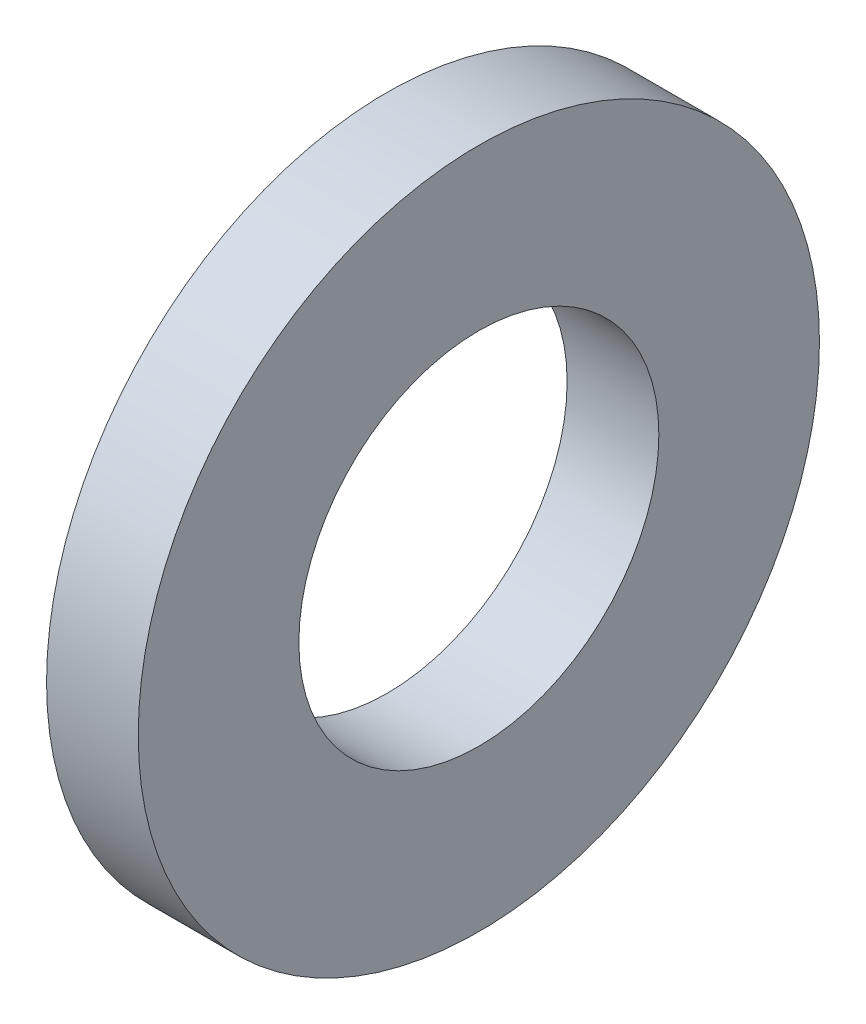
ISO-10303-21;
HEADER;
FILE_DESCRIPTION(('STEP AP214'),'2;1');
FILE_NAME('part.step','',(''),(''),'','','');
FILE_SCHEMA(('AUTOMOTIVE_DESIGN { 1 0 10303 214 1 1 1 1 }'));
ENDSEC;
DATA;
#1=APPLICATION_CONTEXT('core data for automotive mechanical design processes');
#2=APPLICATION_PROTOCOL_DEFINITION('international standard','automotive_design',2000,#1);
#3=PRODUCT_CONTEXT('',#1,'mechanical');
#4=PRODUCT('Part','Part','',(#3));
#5=PRODUCT_RELATED_PRODUCT_CATEGORY('part','',(#4));
#6=PRODUCT_DEFINITION_FORMATION('','',#4);
#7=PRODUCT_DEFINITION_CONTEXT('part definition',#1,'design');
#8=PRODUCT_DEFINITION('design','',#6,#7);
#9=PRODUCT_DEFINITION_SHAPE('','',#8);
#10=(LENGTH_UNIT() NAMED_UNIT(*) SI_UNIT(.MILLI.,.METRE.));
#11=(NAMED_UNIT(*) PLANE_ANGLE_UNIT() SI_UNIT($,.RADIAN.));
#12=(NAMED_UNIT(*) SI_UNIT($,.STERADIAN.) SOLID_ANGLE_UNIT());
#13=UNCERTAINTY_MEASURE_WITH_UNIT(LENGTH_MEASURE(1.E-05),#10,'distance_accuracy_value','');
#14=(GEOMETRIC_REPRESENTATION_CONTEXT(3) GLOBAL_UNCERTAINTY_ASSIGNED_CONTEXT((#13)) GLOBAL_UNIT_ASSIGNED_CONTEXT((#10,
#11,#12)) REPRESENTATION_CONTEXT('',''));
#15=CARTESIAN_POINT('',(0.,0.,0.));
#16=DIRECTION('',(0.,0.,1.));
#17=DIRECTION('',(1.,0.,0.));
#18=AXIS2_PLACEMENT_3D('',#15,#16,#17);
#19=CARTESIAN_POINT('',(-1.75,6.5,0.));
#20=DIRECTION('',(1.,0.,0.));
#21=DIRECTION('',(0.,0.,-1.));
#22=AXIS2_PLACEMENT_3D('',#19,#20,#21);
#23=PLANE('',#22);
#24=CARTESIAN_POINT('',(-1.74999999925,0.,0.));
#25=DIRECTION('',(-1.,0.,0.));
#26=DIRECTION('',(0.,0.,1.));
#27=AXIS2_PLACEMENT_3D('',#24,#25,#26);
#28=CIRCLE('',#27,3.435);
#29=CARTESIAN_POINT('',(-1.74999999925,0.,3.435));
#30=VERTEX_POINT('',#29);
#31=EDGE_CURVE('E27',#30,#30,#28,.F.);
#32=ORIENTED_EDGE('',*,*,#31,.T.);
#33=EDGE_LOOP('',(#32));
#34=FACE_BOUND('',#33,.T.);
#35=CARTESIAN_POINT('',(-1.75,0.,0.));
#36=DIRECTION('',(-1.,0.,0.));
#37=DIRECTION('',(0.,0.,1.));
#38=AXIS2_PLACEMENT_3D('',#35,#36,#37);
#39=CIRCLE('',#38,6.5);
#40=CARTESIAN_POINT('',(-1.75,0.,6.5));
#41=VERTEX_POINT('',#40);
#42=EDGE_CURVE('E18',#41,#41,#39,.F.);
#43=ORIENTED_EDGE('',*,*,#42,.F.);
#44=EDGE_LOOP('',(#43));
#45=FACE_BOUND('',#44,.T.);
#46=ADVANCED_FACE('F15',(#34,#45),#23,.F.);
#47=CARTESIAN_POINT('',(-34.925,0.,0.));
#48=DIRECTION('',(-1.,0.,0.));
#49=DIRECTION('',(0.,0.,1.));
#50=AXIS2_PLACEMENT_3D('',#47,#48,#49);
#51=CYLINDRICAL_SURFACE('',#50,6.5);
#52=ORIENTED_EDGE('',*,*,#42,.T.);
#53=EDGE_LOOP('',(#52));
#54=FACE_BOUND('',#53,.T.);
#55=CARTESIAN_POINT('',(0.,0.,0.));
#56=DIRECTION('',(-1.,0.,0.));
#57=DIRECTION('',(0.,0.,1.));
#58=AXIS2_PLACEMENT_3D('',#55,#56,#57);
#59=CIRCLE('',#58,6.5);
#60=CARTESIAN_POINT('',(0.,0.,6.5));
#61=VERTEX_POINT('',#60);
#62=EDGE_CURVE('E22',#61,#61,#59,.T.);
#63=ORIENTED_EDGE('',*,*,#62,.T.);
#64=EDGE_LOOP('',(#63));
#65=FACE_BOUND('',#64,.T.);
#66=ADVANCED_FACE('F35',(#54,#65),#51,.T.);
#67=CARTESIAN_POINT('',(-34.925,0.,0.));
#68=DIRECTION('',(-1.,0.,0.));
#69=DIRECTION('',(0.,0.,1.));
#70=AXIS2_PLACEMENT_3D('',#67,#68,#69);
#71=CYLINDRICAL_SURFACE('',#70,3.435);
#72=CARTESIAN_POINT('',(0.,0.,0.));
#73=DIRECTION('',(-1.,0.,0.));
#74=DIRECTION('',(0.,0.,1.));
#75=AXIS2_PLACEMENT_3D('',#72,#73,#74);
#76=CIRCLE('',#75,3.435);
#77=CARTESIAN_POINT('',(0.,0.,3.435));
#78=VERTEX_POINT('',#77);
#79=EDGE_CURVE('E10',#78,#78,#76,.F.);
#80=ORIENTED_EDGE('',*,*,#79,.T.);
#81=EDGE_LOOP('',(#80));
#82=FACE_BOUND('',#81,.T.);
#83=ORIENTED_EDGE('',*,*,#31,.F.);
#84=EDGE_LOOP('',(#83));
#85=FACE_BOUND('',#84,.T.);
#86=ADVANCED_FACE('F43',(#82,#85),#71,.F.);
#87=CARTESIAN_POINT('',(0.,3.435,0.));
#88=DIRECTION('',(-1.,0.,0.));
#89=DIRECTION('',(0.,0.,1.));
#90=AXIS2_PLACEMENT_3D('',#87,#88,#89);
#91=PLANE('',#90);
#92=ORIENTED_EDGE('',*,*,#79,.F.);
#93=EDGE_LOOP('',(#92));
#94=FACE_BOUND('',#93,.T.);
#95=ORIENTED_EDGE('',*,*,#62,.F.);
#96=EDGE_LOOP('',(#95));
#97=FACE_BOUND('',#96,.T.);
#98=ADVANCED_FACE('F44',(#94,#97),#91,.F.);
#99=CLOSED_SHELL('',(#46,#66,#86,#98));
#100=MANIFOLD_SOLID_BREP('B1',#99);
#101=ADVANCED_BREP_SHAPE_REPRESENTATION('',(#18,#100),#14);
#102=SHAPE_DEFINITION_REPRESENTATION(#9,#101);
ENDSEC;
END-ISO-10303-21;
